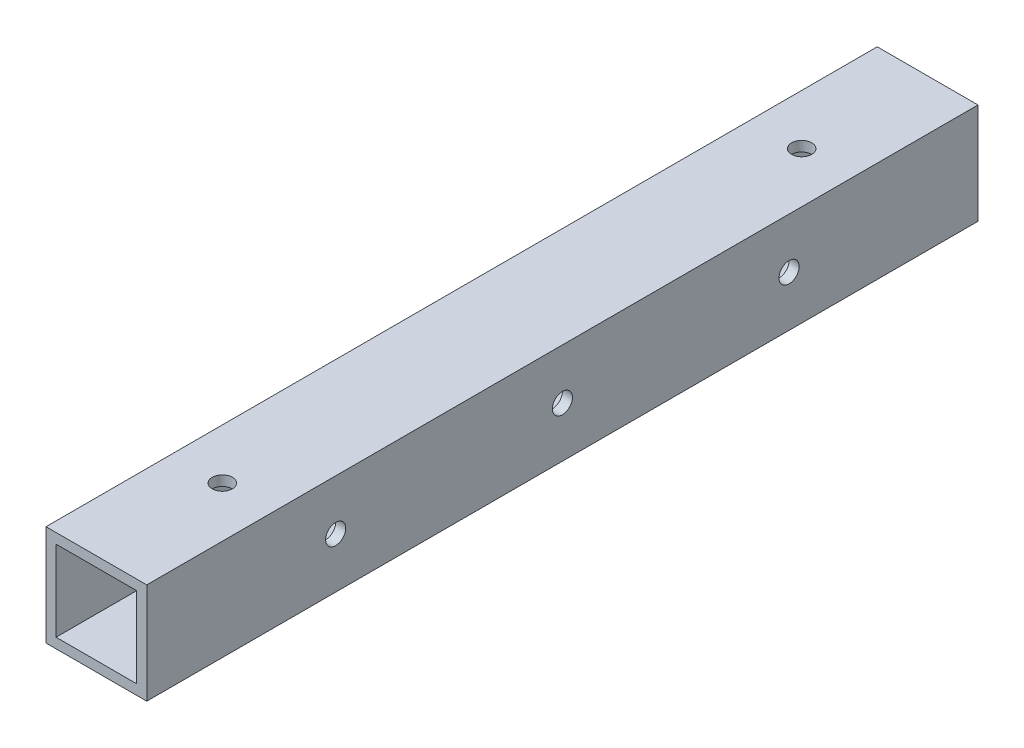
from build123d import *

# Parameters (mm, degrees)
SKETCH_1_W            = 20
SKETCH_1_H            = 20
SKETCH_1_W_2          = 16
SKETCH_1_H_2          = 16
EXTRUDE_1_DEPTH       = 165
HOLE_WIZARD_4_0_4_1_D = 4
HOLE_WIZARD_4_0_4_2_D = 4


with BuildPart() as part:
    # Sketch 1 → Extrude 1 (new body)
    with BuildSketch(Plane.XY):
        Rectangle(SKETCH_1_W, SKETCH_1_H)
        Rectangle(SKETCH_1_W_2, SKETCH_1_H_2, mode=Mode.SUBTRACT)
    extrude(amount=EXTRUDE_1_DEPTH)

    # Hole Wizard 4.0 _4_ _1 (through all)
    with Locations(Plane(origin=(0, 10, 0), x_dir=(1, 0, 0), z_dir=(0, 1, 0))):
        with Locations((0, -140), (0, -25)):
            Hole(HOLE_WIZARD_4_0_4_1_D / 2)

    # Hole Wizard 4.0 _4_ _2 (through all)
    with Locations(Plane.ZY.offset(10)):
        with Locations((37.5, 0), (82.5, 0), (127.5, 0)):
            Hole(HOLE_WIZARD_4_0_4_2_D / 2)


solid = part.part
